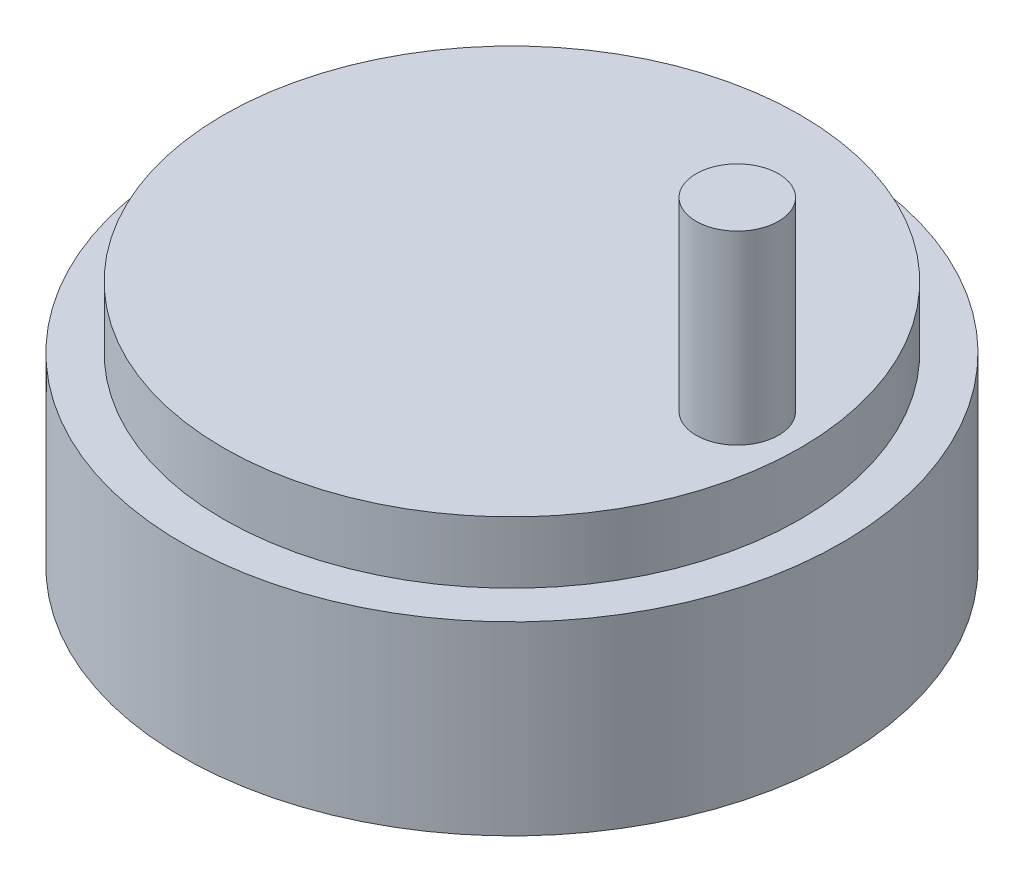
ISO-10303-21;
HEADER;
FILE_DESCRIPTION(('STEP AP214'),'2;1');
FILE_NAME('part.step','',(''),(''),'','','');
FILE_SCHEMA(('AUTOMOTIVE_DESIGN { 1 0 10303 214 1 1 1 1 }'));
ENDSEC;
DATA;
#1=APPLICATION_CONTEXT('core data for automotive mechanical design processes');
#2=APPLICATION_PROTOCOL_DEFINITION('international standard','automotive_design',2000,#1);
#3=PRODUCT_CONTEXT('',#1,'mechanical');
#4=PRODUCT('Part','Part','',(#3));
#5=PRODUCT_RELATED_PRODUCT_CATEGORY('part','',(#4));
#6=PRODUCT_DEFINITION_FORMATION('','',#4);
#7=PRODUCT_DEFINITION_CONTEXT('part definition',#1,'design');
#8=PRODUCT_DEFINITION('design','',#6,#7);
#9=PRODUCT_DEFINITION_SHAPE('','',#8);
#10=(LENGTH_UNIT() NAMED_UNIT(*) SI_UNIT(.MILLI.,.METRE.));
#11=(NAMED_UNIT(*) PLANE_ANGLE_UNIT() SI_UNIT($,.RADIAN.));
#12=(NAMED_UNIT(*) SI_UNIT($,.STERADIAN.) SOLID_ANGLE_UNIT());
#13=UNCERTAINTY_MEASURE_WITH_UNIT(LENGTH_MEASURE(1.E-05),#10,'distance_accuracy_value','');
#14=(GEOMETRIC_REPRESENTATION_CONTEXT(3) GLOBAL_UNCERTAINTY_ASSIGNED_CONTEXT((#13)) GLOBAL_UNIT_ASSIGNED_CONTEXT((#10,
#11,#12)) REPRESENTATION_CONTEXT('',''));
#15=CARTESIAN_POINT('',(0.,0.,0.));
#16=DIRECTION('',(0.,0.,1.));
#17=DIRECTION('',(1.,0.,0.));
#18=AXIS2_PLACEMENT_3D('',#15,#16,#17);
#19=CARTESIAN_POINT('',(0.,6.,0.));
#20=DIRECTION('',(0.,-1.,0.));
#21=DIRECTION('',(0.,0.,-1.));
#22=AXIS2_PLACEMENT_3D('',#19,#20,#21);
#23=CYLINDRICAL_SURFACE('',#22,7.);
#24=CARTESIAN_POINT('',(0.,6.,0.));
#25=DIRECTION('',(0.,1.,0.));
#26=DIRECTION('',(0.,0.,1.));
#27=AXIS2_PLACEMENT_3D('',#24,#25,#26);
#28=CIRCLE('',#27,7.);
#29=CARTESIAN_POINT('',(0.,6.,7.));
#30=VERTEX_POINT('',#29);
#31=EDGE_CURVE('E39',#30,#30,#28,.T.);
#32=ORIENTED_EDGE('',*,*,#31,.F.);
#33=EDGE_LOOP('',(#32));
#34=FACE_BOUND('',#33,.T.);
#35=CARTESIAN_POINT('',(0.,4.5,0.));
#36=DIRECTION('',(0.,-1.,0.));
#37=DIRECTION('',(0.,0.,-1.));
#38=AXIS2_PLACEMENT_3D('',#35,#36,#37);
#39=CIRCLE('',#38,7.);
#40=CARTESIAN_POINT('',(0.,4.5,-7.));
#41=VERTEX_POINT('',#40);
#42=EDGE_CURVE('E10',#41,#41,#39,.T.);
#43=ORIENTED_EDGE('',*,*,#42,.F.);
#44=EDGE_LOOP('',(#43));
#45=FACE_BOUND('',#44,.T.);
#46=ADVANCED_FACE('F33',(#34,#45),#23,.T.);
#47=CARTESIAN_POINT('',(0.,6.,0.));
#48=DIRECTION('',(0.,1.,0.));
#49=DIRECTION('',(0.,0.,1.));
#50=AXIS2_PLACEMENT_3D('',#47,#48,#49);
#51=PLANE('',#50);
#52=ORIENTED_EDGE('',*,*,#31,.T.);
#53=EDGE_LOOP('',(#52));
#54=FACE_BOUND('',#53,.T.);
#55=CARTESIAN_POINT('',(5.47095,6.,0.));
#56=DIRECTION('',(0.,1.,0.));
#57=DIRECTION('',(0.,0.,1.));
#58=AXIS2_PLACEMENT_3D('',#55,#56,#57);
#59=CIRCLE('',#58,1.);
#60=CARTESIAN_POINT('',(5.47095,6.,1.));
#61=VERTEX_POINT('',#60);
#62=EDGE_CURVE('E47',#61,#61,#59,.T.);
#63=ORIENTED_EDGE('',*,*,#62,.F.);
#64=EDGE_LOOP('',(#63));
#65=FACE_BOUND('',#64,.T.);
#66=ADVANCED_FACE('F76',(#54,#65),#51,.T.);
#67=CARTESIAN_POINT('',(5.47095,10.5,0.));
#68=DIRECTION('',(0.,-1.,0.));
#69=DIRECTION('',(0.,0.,-1.));
#70=AXIS2_PLACEMENT_3D('',#67,#68,#69);
#71=CYLINDRICAL_SURFACE('',#70,1.);
#72=CARTESIAN_POINT('',(5.47095,10.5,0.));
#73=DIRECTION('',(0.,1.,0.));
#74=DIRECTION('',(0.,0.,1.));
#75=AXIS2_PLACEMENT_3D('',#72,#73,#74);
#76=CIRCLE('',#75,1.);
#77=CARTESIAN_POINT('',(5.47095,10.5,1.));
#78=VERTEX_POINT('',#77);
#79=EDGE_CURVE('E43',#78,#78,#76,.T.);
#80=ORIENTED_EDGE('',*,*,#79,.F.);
#81=EDGE_LOOP('',(#80));
#82=FACE_BOUND('',#81,.T.);
#83=ORIENTED_EDGE('',*,*,#62,.T.);
#84=EDGE_LOOP('',(#83));
#85=FACE_BOUND('',#84,.T.);
#86=ADVANCED_FACE('F72',(#82,#85),#71,.T.);
#87=CARTESIAN_POINT('',(5.47095,10.5,0.));
#88=DIRECTION('',(0.,1.,0.));
#89=DIRECTION('',(0.,0.,1.));
#90=AXIS2_PLACEMENT_3D('',#87,#88,#89);
#91=PLANE('',#90);
#92=ORIENTED_EDGE('',*,*,#79,.T.);
#93=EDGE_LOOP('',(#92));
#94=FACE_BOUND('',#93,.T.);
#95=ADVANCED_FACE('F64',(#94),#91,.T.);
#96=CARTESIAN_POINT('',(0.,4.5,0.));
#97=DIRECTION('',(0.,-1.,0.));
#98=DIRECTION('',(0.,0.,-1.));
#99=AXIS2_PLACEMENT_3D('',#96,#97,#98);
#100=PLANE('',#99);
#101=CARTESIAN_POINT('',(0.,4.5,0.));
#102=DIRECTION('',(0.,-1.,0.));
#103=DIRECTION('',(0.,0.,-1.));
#104=AXIS2_PLACEMENT_3D('',#101,#102,#103);
#105=CIRCLE('',#104,8.);
#106=CARTESIAN_POINT('',(0.,4.5,-8.));
#107=VERTEX_POINT('',#106);
#108=EDGE_CURVE('E51',#107,#107,#105,.T.);
#109=ORIENTED_EDGE('',*,*,#108,.F.);
#110=EDGE_LOOP('',(#109));
#111=FACE_BOUND('',#110,.T.);
#112=ORIENTED_EDGE('',*,*,#42,.T.);
#113=EDGE_LOOP('',(#112));
#114=FACE_BOUND('',#113,.T.);
#115=ADVANCED_FACE('F62',(#111,#114),#100,.F.);
#116=CARTESIAN_POINT('',(0.,4.5,0.));
#117=DIRECTION('',(0.,-1.,0.));
#118=DIRECTION('',(0.,0.,-1.));
#119=AXIS2_PLACEMENT_3D('',#116,#117,#118);
#120=CYLINDRICAL_SURFACE('',#119,8.);
#121=ORIENTED_EDGE('',*,*,#108,.T.);
#122=EDGE_LOOP('',(#121));
#123=FACE_BOUND('',#122,.T.);
#124=CARTESIAN_POINT('',(0.,0.,0.));
#125=DIRECTION('',(0.,-1.,0.));
#126=DIRECTION('',(0.,0.,-1.));
#127=AXIS2_PLACEMENT_3D('',#124,#125,#126);
#128=CIRCLE('',#127,8.);
#129=CARTESIAN_POINT('',(0.,0.,-8.));
#130=VERTEX_POINT('',#129);
#131=EDGE_CURVE('E53',#130,#130,#128,.T.);
#132=ORIENTED_EDGE('',*,*,#131,.F.);
#133=EDGE_LOOP('',(#132));
#134=FACE_BOUND('',#133,.T.);
#135=ADVANCED_FACE('F59',(#123,#134),#120,.T.);
#136=CARTESIAN_POINT('',(0.,0.,0.));
#137=DIRECTION('',(0.,1.,0.));
#138=DIRECTION('',(0.,0.,1.));
#139=AXIS2_PLACEMENT_3D('',#136,#137,#138);
#140=PLANE('',#139);
#141=ORIENTED_EDGE('',*,*,#131,.T.);
#142=EDGE_LOOP('',(#141));
#143=FACE_BOUND('',#142,.T.);
#144=ADVANCED_FACE('F70',(#143),#140,.F.);
#145=CLOSED_SHELL('',(#46,#66,#86,#95,#115,#135,#144));
#146=MANIFOLD_SOLID_BREP('B2',#145);
#147=ADVANCED_BREP_SHAPE_REPRESENTATION('',(#18,#146),#14);
#148=SHAPE_DEFINITION_REPRESENTATION(#9,#147);
ENDSEC;
END-ISO-10303-21;
